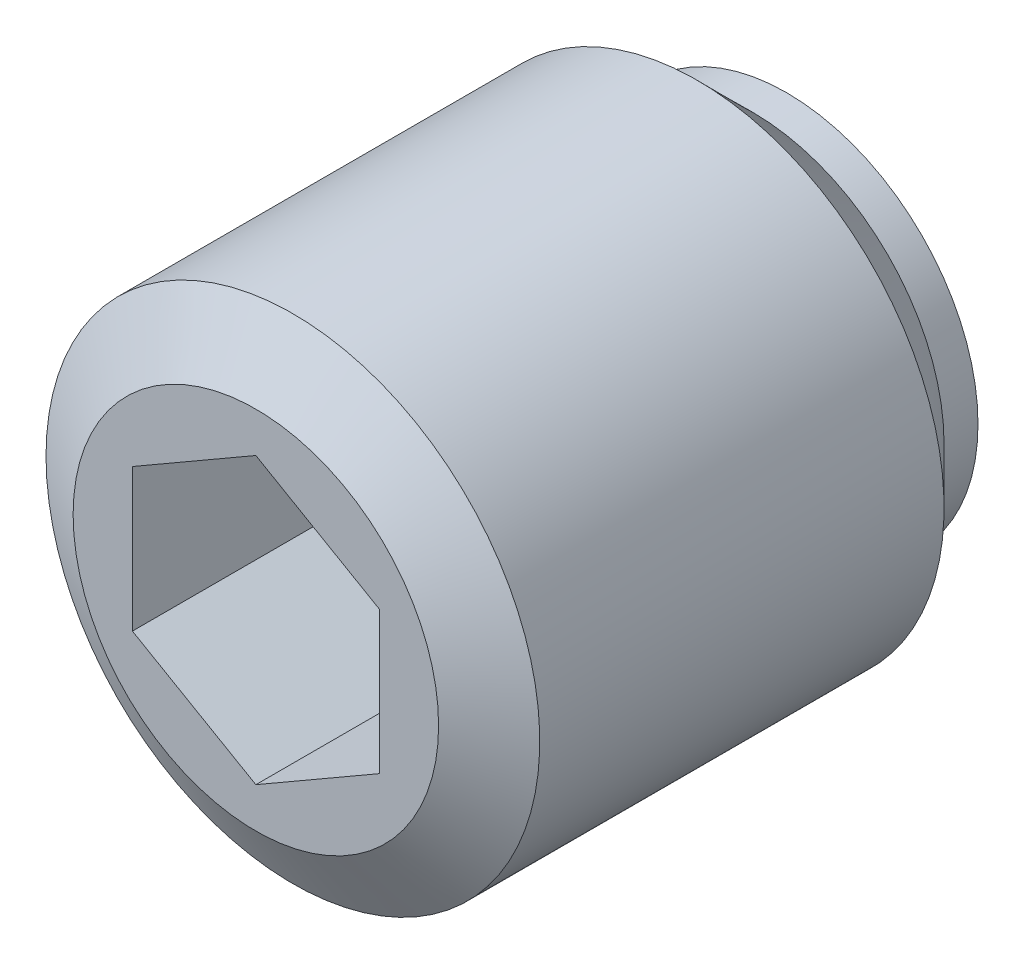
ISO-10303-21;
HEADER;
FILE_DESCRIPTION(('STEP AP214'),'2;1');
FILE_NAME('part.step','',(''),(''),'','','');
FILE_SCHEMA(('AUTOMOTIVE_DESIGN { 1 0 10303 214 1 1 1 1 }'));
ENDSEC;
DATA;
#1=APPLICATION_CONTEXT('core data for automotive mechanical design processes');
#2=APPLICATION_PROTOCOL_DEFINITION('international standard','automotive_design',2000,#1);
#3=PRODUCT_CONTEXT('',#1,'mechanical');
#4=PRODUCT('Part','Part','',(#3));
#5=PRODUCT_RELATED_PRODUCT_CATEGORY('part','',(#4));
#6=PRODUCT_DEFINITION_FORMATION('','',#4);
#7=PRODUCT_DEFINITION_CONTEXT('part definition',#1,'design');
#8=PRODUCT_DEFINITION('design','',#6,#7);
#9=PRODUCT_DEFINITION_SHAPE('','',#8);
#10=(LENGTH_UNIT() NAMED_UNIT(*) SI_UNIT(.MILLI.,.METRE.));
#11=(NAMED_UNIT(*) PLANE_ANGLE_UNIT() SI_UNIT($,.RADIAN.));
#12=(NAMED_UNIT(*) SI_UNIT($,.STERADIAN.) SOLID_ANGLE_UNIT());
#13=UNCERTAINTY_MEASURE_WITH_UNIT(LENGTH_MEASURE(1.E-05),#10,'distance_accuracy_value','');
#14=(GEOMETRIC_REPRESENTATION_CONTEXT(3) GLOBAL_UNCERTAINTY_ASSIGNED_CONTEXT((#13)) GLOBAL_UNIT_ASSIGNED_CONTEXT((#10,
#11,#12)) REPRESENTATION_CONTEXT('',''));
#15=CARTESIAN_POINT('',(0.,0.,0.));
#16=DIRECTION('',(0.,0.,1.));
#17=DIRECTION('',(1.,0.,0.));
#18=AXIS2_PLACEMENT_3D('',#15,#16,#17);
#19=CARTESIAN_POINT('',(0.,0.,2.75));
#20=DIRECTION('',(0.,0.,1.));
#21=DIRECTION('',(0.,-1.,0.));
#22=AXIS2_PLACEMENT_3D('',#19,#20,#21);
#23=SPHERICAL_SURFACE('',#22,2.75);
#24=CARTESIAN_POINT('',(0.,0.,1.4));
#25=DIRECTION('',(0.,0.,1.));
#26=DIRECTION('',(-1.,0.,0.));
#27=AXIS2_PLACEMENT_3D('',#24,#25,#26);
#28=CIRCLE('',#27,2.39582971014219);
#29=CARTESIAN_POINT('',(-2.39582971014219,0.,1.4));
#30=VERTEX_POINT('',#29);
#31=EDGE_CURVE('E9',#30,#30,#28,.T.);
#32=ORIENTED_EDGE('',*,*,#31,.F.);
#33=EDGE_LOOP('',(#32));
#34=FACE_BOUND('',#33,.T.);
#35=ADVANCED_FACE('F14',(#34),#23,.T.);
#36=CARTESIAN_POINT('',(0.,3.1,1.4));
#37=DIRECTION('',(0.,0.,1.));
#38=DIRECTION('',(-1.,0.,0.));
#39=AXIS2_PLACEMENT_3D('',#36,#37,#38);
#40=PLANE('',#39);
#41=CARTESIAN_POINT('',(0.,0.,1.4));
#42=DIRECTION('',(0.,0.,1.));
#43=DIRECTION('',(-1.,0.,0.));
#44=AXIS2_PLACEMENT_3D('',#41,#42,#43);
#45=CIRCLE('',#44,3.1);
#46=CARTESIAN_POINT('',(-3.1,0.,1.4));
#47=VERTEX_POINT('',#46);
#48=EDGE_CURVE('E21',#47,#47,#45,.T.);
#49=ORIENTED_EDGE('',*,*,#48,.F.);
#50=EDGE_LOOP('',(#49));
#51=FACE_BOUND('',#50,.T.);
#52=ORIENTED_EDGE('',*,*,#31,.T.);
#53=EDGE_LOOP('',(#52));
#54=FACE_BOUND('',#53,.T.);
#55=ADVANCED_FACE('F138',(#51,#54),#40,.F.);
#56=CARTESIAN_POINT('',(0.,0.,11.3950749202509));
#57=DIRECTION('',(0.,0.,1.));
#58=DIRECTION('',(-1.,0.,0.));
#59=AXIS2_PLACEMENT_3D('',#56,#57,#58);
#60=CYLINDRICAL_SURFACE('',#59,3.1);
#61=CARTESIAN_POINT('',(0.,0.,1.95));
#62=DIRECTION('',(0.,0.,1.));
#63=DIRECTION('',(-1.,0.,0.));
#64=AXIS2_PLACEMENT_3D('',#61,#62,#63);
#65=CIRCLE('',#64,3.1);
#66=CARTESIAN_POINT('',(-3.1,0.,1.95));
#67=VERTEX_POINT('',#66);
#68=EDGE_CURVE('E131',#67,#67,#65,.T.);
#69=ORIENTED_EDGE('',*,*,#68,.F.);
#70=EDGE_LOOP('',(#69));
#71=FACE_BOUND('',#70,.T.);
#72=ORIENTED_EDGE('',*,*,#48,.T.);
#73=EDGE_LOOP('',(#72));
#74=FACE_BOUND('',#73,.T.);
#75=ADVANCED_FACE('F136',(#71,#74),#60,.T.);
#76=CARTESIAN_POINT('',(0.,0.,1.95));
#77=DIRECTION('',(0.,0.,1.));
#78=DIRECTION('',(-1.,0.,0.));
#79=AXIS2_PLACEMENT_3D('',#76,#77,#78);
#80=CONICAL_SURFACE('',#79,3.1,0.78539816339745);
#81=CARTESIAN_POINT('',(0.,0.,2.85));
#82=DIRECTION('',(0.,0.,1.));
#83=DIRECTION('',(-1.,0.,0.));
#84=AXIS2_PLACEMENT_3D('',#81,#82,#83);
#85=CIRCLE('',#84,4.);
#86=CARTESIAN_POINT('',(-4.,0.,2.85));
#87=VERTEX_POINT('',#86);
#88=EDGE_CURVE('E128',#87,#87,#85,.T.);
#89=ORIENTED_EDGE('',*,*,#88,.F.);
#90=EDGE_LOOP('',(#89));
#91=FACE_BOUND('',#90,.T.);
#92=ORIENTED_EDGE('',*,*,#68,.T.);
#93=EDGE_LOOP('',(#92));
#94=FACE_BOUND('',#93,.T.);
#95=ADVANCED_FACE('F161',(#91,#94),#80,.T.);
#96=CARTESIAN_POINT('',(0.,0.,11.3950749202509));
#97=DIRECTION('',(0.,0.,1.));
#98=DIRECTION('',(-1.,0.,0.));
#99=AXIS2_PLACEMENT_3D('',#96,#97,#98);
#100=CYLINDRICAL_SURFACE('',#99,4.);
#101=CARTESIAN_POINT('',(0.,0.,9.4));
#102=DIRECTION('',(0.,0.,1.));
#103=DIRECTION('',(-1.,0.,0.));
#104=AXIS2_PLACEMENT_3D('',#101,#102,#103);
#105=CIRCLE('',#104,4.);
#106=CARTESIAN_POINT('',(-4.,0.,9.4));
#107=VERTEX_POINT('',#106);
#108=EDGE_CURVE('E125',#107,#107,#105,.T.);
#109=ORIENTED_EDGE('',*,*,#108,.F.);
#110=EDGE_LOOP('',(#109));
#111=FACE_BOUND('',#110,.T.);
#112=ORIENTED_EDGE('',*,*,#88,.T.);
#113=EDGE_LOOP('',(#112));
#114=FACE_BOUND('',#113,.T.);
#115=ADVANCED_FACE('F170',(#111,#114),#100,.T.);
#116=CARTESIAN_POINT('',(0.,0.,9.4));
#117=DIRECTION('',(0.,0.,-1.));
#118=DIRECTION('',(1.,0.,0.));
#119=AXIS2_PLACEMENT_3D('',#116,#117,#118);
#120=CONICAL_SURFACE('',#119,4.,1.04719755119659);
#121=CARTESIAN_POINT('',(0.,0.,10.));
#122=DIRECTION('',(0.,0.,1.));
#123=DIRECTION('',(-1.,0.,0.));
#124=AXIS2_PLACEMENT_3D('',#121,#122,#123);
#125=CIRCLE('',#124,2.9607695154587);
#126=CARTESIAN_POINT('',(-2.9607695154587,0.,10.));
#127=VERTEX_POINT('',#126);
#128=EDGE_CURVE('E116',#127,#127,#125,.T.);
#129=ORIENTED_EDGE('',*,*,#128,.F.);
#130=EDGE_LOOP('',(#129));
#131=FACE_BOUND('',#130,.T.);
#132=ORIENTED_EDGE('',*,*,#108,.T.);
#133=EDGE_LOOP('',(#132));
#134=FACE_BOUND('',#133,.T.);
#135=ADVANCED_FACE('F179',(#131,#134),#120,.T.);
#136=CARTESIAN_POINT('',(0.,0.,10.));
#137=DIRECTION('',(0.,0.,-1.));
#138=DIRECTION('',(1.,0.,0.));
#139=AXIS2_PLACEMENT_3D('',#136,#137,#138);
#140=PLANE('',#139);
#141=DIRECTION('',(-0.866025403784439,-0.5,0.));
#142=VECTOR('',#141,1.);
#143=CARTESIAN_POINT('',(0.,2.30940107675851,10.));
#144=LINE('',#143,#142);
#145=CARTESIAN_POINT('',(0.,2.30940107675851,10.));
#146=VERTEX_POINT('',#145);
#147=CARTESIAN_POINT('',(-2.,1.15470053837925,10.));
#148=VERTEX_POINT('',#147);
#149=EDGE_CURVE('E82',#146,#148,#144,.T.);
#150=ORIENTED_EDGE('',*,*,#149,.F.);
#151=DIRECTION('',(-0.866025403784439,0.5,0.));
#152=VECTOR('',#151,1.);
#153=CARTESIAN_POINT('',(2.,1.15470053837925,10.));
#154=LINE('',#153,#152);
#155=CARTESIAN_POINT('',(2.,1.15470053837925,10.));
#156=VERTEX_POINT('',#155);
#157=EDGE_CURVE('E28',#156,#146,#154,.T.);
#158=ORIENTED_EDGE('',*,*,#157,.F.);
#159=DIRECTION('',(0.,1.,0.));
#160=VECTOR('',#159,1.);
#161=CARTESIAN_POINT('',(2.,-1.15470053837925,10.));
#162=LINE('',#161,#160);
#163=CARTESIAN_POINT('',(2.,-1.15470053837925,10.));
#164=VERTEX_POINT('',#163);
#165=EDGE_CURVE('E98',#164,#156,#162,.T.);
#166=ORIENTED_EDGE('',*,*,#165,.F.);
#167=DIRECTION('',(0.866025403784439,0.5,0.));
#168=VECTOR('',#167,1.);
#169=CARTESIAN_POINT('',(0.,-2.30940107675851,10.));
#170=LINE('',#169,#168);
#171=CARTESIAN_POINT('',(0.,-2.30940107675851,10.));
#172=VERTEX_POINT('',#171);
#173=EDGE_CURVE('E92',#172,#164,#170,.T.);
#174=ORIENTED_EDGE('',*,*,#173,.F.);
#175=DIRECTION('',(0.866025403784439,-0.5,0.));
#176=VECTOR('',#175,1.);
#177=CARTESIAN_POINT('',(-2.,-1.15470053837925,10.));
#178=LINE('',#177,#176);
#179=CARTESIAN_POINT('',(-2.,-1.15470053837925,10.));
#180=VERTEX_POINT('',#179);
#181=EDGE_CURVE('E90',#180,#172,#178,.T.);
#182=ORIENTED_EDGE('',*,*,#181,.F.);
#183=DIRECTION('',(0.,-1.,0.));
#184=VECTOR('',#183,1.);
#185=CARTESIAN_POINT('',(-2.,1.15470053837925,10.));
#186=LINE('',#185,#184);
#187=EDGE_CURVE('E71',#148,#180,#186,.T.);
#188=ORIENTED_EDGE('',*,*,#187,.F.);
#189=EDGE_LOOP('',(#150,#158,#166,#174,#182,#188));
#190=FACE_BOUND('',#189,.T.);
#191=ORIENTED_EDGE('',*,*,#128,.T.);
#192=EDGE_LOOP('',(#191));
#193=FACE_BOUND('',#192,.T.);
#194=ADVANCED_FACE('F86',(#190,#193),#140,.F.);
#195=CARTESIAN_POINT('',(2.,1.15470053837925,6.));
#196=DIRECTION('',(0.5,0.866025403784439,0.));
#197=DIRECTION('',(0.866025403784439,-0.5,0.));
#198=AXIS2_PLACEMENT_3D('',#195,#196,#197);
#199=PLANE('',#198);
#200=ORIENTED_EDGE('',*,*,#157,.T.);
#201=DIRECTION('',(0.,0.,1.));
#202=VECTOR('',#201,1.);
#203=CARTESIAN_POINT('',(0.,2.30940107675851,6.));
#204=LINE('',#203,#202);
#205=CARTESIAN_POINT('',(0.,2.30940107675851,6.));
#206=VERTEX_POINT('',#205);
#207=EDGE_CURVE('E79',#206,#146,#204,.T.);
#208=ORIENTED_EDGE('',*,*,#207,.F.);
#209=DIRECTION('',(-0.866025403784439,0.5,0.));
#210=VECTOR('',#209,1.);
#211=CARTESIAN_POINT('',(2.,1.15470053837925,6.));
#212=LINE('',#211,#210);
#213=CARTESIAN_POINT('',(2.,1.15470053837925,6.));
#214=VERTEX_POINT('',#213);
#215=EDGE_CURVE('E100',#214,#206,#212,.T.);
#216=ORIENTED_EDGE('',*,*,#215,.F.);
#217=DIRECTION('',(0.,0.,1.));
#218=VECTOR('',#217,1.);
#219=CARTESIAN_POINT('',(2.,1.15470053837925,6.));
#220=LINE('',#219,#218);
#221=EDGE_CURVE('E35',#214,#156,#220,.T.);
#222=ORIENTED_EDGE('',*,*,#221,.T.);
#223=EDGE_LOOP('',(#200,#208,#216,#222));
#224=FACE_BOUND('',#223,.T.);
#225=ADVANCED_FACE('F196',(#224),#199,.F.);
#226=CARTESIAN_POINT('',(2.,-1.15470053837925,6.));
#227=DIRECTION('',(1.,0.,0.));
#228=DIRECTION('',(0.,0.,1.));
#229=AXIS2_PLACEMENT_3D('',#226,#227,#228);
#230=PLANE('',#229);
#231=ORIENTED_EDGE('',*,*,#165,.T.);
#232=ORIENTED_EDGE('',*,*,#221,.F.);
#233=DIRECTION('',(0.,1.,0.));
#234=VECTOR('',#233,1.);
#235=CARTESIAN_POINT('',(2.,-1.15470053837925,6.));
#236=LINE('',#235,#234);
#237=CARTESIAN_POINT('',(2.,-1.15470053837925,6.));
#238=VERTEX_POINT('',#237);
#239=EDGE_CURVE('E112',#238,#214,#236,.T.);
#240=ORIENTED_EDGE('',*,*,#239,.F.);
#241=DIRECTION('',(0.,0.,1.));
#242=VECTOR('',#241,1.);
#243=CARTESIAN_POINT('',(2.,-1.15470053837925,6.));
#244=LINE('',#243,#242);
#245=EDGE_CURVE('E117',#238,#164,#244,.T.);
#246=ORIENTED_EDGE('',*,*,#245,.T.);
#247=EDGE_LOOP('',(#231,#232,#240,#246));
#248=FACE_BOUND('',#247,.T.);
#249=ADVANCED_FACE('F204',(#248),#230,.F.);
#250=CARTESIAN_POINT('',(0.,-2.30940107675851,6.));
#251=DIRECTION('',(0.5,-0.866025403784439,0.));
#252=DIRECTION('',(-0.866025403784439,-0.5,0.));
#253=AXIS2_PLACEMENT_3D('',#250,#251,#252);
#254=PLANE('',#253);
#255=ORIENTED_EDGE('',*,*,#173,.T.);
#256=ORIENTED_EDGE('',*,*,#245,.F.);
#257=DIRECTION('',(0.866025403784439,0.5,0.));
#258=VECTOR('',#257,1.);
#259=CARTESIAN_POINT('',(0.,-2.30940107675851,6.));
#260=LINE('',#259,#258);
#261=CARTESIAN_POINT('',(0.,-2.30940107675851,6.));
#262=VERTEX_POINT('',#261);
#263=EDGE_CURVE('E109',#262,#238,#260,.T.);
#264=ORIENTED_EDGE('',*,*,#263,.F.);
#265=DIRECTION('',(0.,0.,1.));
#266=VECTOR('',#265,1.);
#267=CARTESIAN_POINT('',(0.,-2.30940107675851,6.));
#268=LINE('',#267,#266);
#269=EDGE_CURVE('E119',#262,#172,#268,.T.);
#270=ORIENTED_EDGE('',*,*,#269,.T.);
#271=EDGE_LOOP('',(#255,#256,#264,#270));
#272=FACE_BOUND('',#271,.T.);
#273=ADVANCED_FACE('F212',(#272),#254,.F.);
#274=CARTESIAN_POINT('',(-2.,-1.15470053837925,6.));
#275=DIRECTION('',(-0.5,-0.866025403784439,0.));
#276=DIRECTION('',(-0.866025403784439,0.5,0.));
#277=AXIS2_PLACEMENT_3D('',#274,#275,#276);
#278=PLANE('',#277);
#279=ORIENTED_EDGE('',*,*,#181,.T.);
#280=ORIENTED_EDGE('',*,*,#269,.F.);
#281=DIRECTION('',(0.866025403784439,-0.5,0.));
#282=VECTOR('',#281,1.);
#283=CARTESIAN_POINT('',(-2.,-1.15470053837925,6.));
#284=LINE('',#283,#282);
#285=CARTESIAN_POINT('',(-2.,-1.15470053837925,6.));
#286=VERTEX_POINT('',#285);
#287=EDGE_CURVE('E106',#286,#262,#284,.T.);
#288=ORIENTED_EDGE('',*,*,#287,.F.);
#289=DIRECTION('',(0.,0.,1.));
#290=VECTOR('',#289,1.);
#291=CARTESIAN_POINT('',(-2.,-1.15470053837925,6.));
#292=LINE('',#291,#290);
#293=EDGE_CURVE('E78',#286,#180,#292,.T.);
#294=ORIENTED_EDGE('',*,*,#293,.T.);
#295=EDGE_LOOP('',(#279,#280,#288,#294));
#296=FACE_BOUND('',#295,.T.);
#297=ADVANCED_FACE('F220',(#296),#278,.F.);
#298=CARTESIAN_POINT('',(-2.,1.15470053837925,6.));
#299=DIRECTION('',(-1.,0.,0.));
#300=DIRECTION('',(0.,1.,0.));
#301=AXIS2_PLACEMENT_3D('',#298,#299,#300);
#302=PLANE('',#301);
#303=ORIENTED_EDGE('',*,*,#187,.T.);
#304=ORIENTED_EDGE('',*,*,#293,.F.);
#305=DIRECTION('',(0.,-1.,0.));
#306=VECTOR('',#305,1.);
#307=CARTESIAN_POINT('',(-2.,1.15470053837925,6.));
#308=LINE('',#307,#306);
#309=CARTESIAN_POINT('',(-2.,1.15470053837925,6.));
#310=VERTEX_POINT('',#309);
#311=EDGE_CURVE('E74',#310,#286,#308,.T.);
#312=ORIENTED_EDGE('',*,*,#311,.F.);
#313=DIRECTION('',(0.,0.,1.));
#314=VECTOR('',#313,1.);
#315=CARTESIAN_POINT('',(-2.,1.15470053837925,6.));
#316=LINE('',#315,#314);
#317=EDGE_CURVE('E67',#310,#148,#316,.T.);
#318=ORIENTED_EDGE('',*,*,#317,.T.);
#319=EDGE_LOOP('',(#303,#304,#312,#318));
#320=FACE_BOUND('',#319,.T.);
#321=ADVANCED_FACE('F69',(#320),#302,.F.);
#322=CARTESIAN_POINT('',(0.,2.30940107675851,6.));
#323=DIRECTION('',(-0.5,0.866025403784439,0.));
#324=DIRECTION('',(0.866025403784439,0.5,0.));
#325=AXIS2_PLACEMENT_3D('',#322,#323,#324);
#326=PLANE('',#325);
#327=ORIENTED_EDGE('',*,*,#149,.T.);
#328=ORIENTED_EDGE('',*,*,#317,.F.);
#329=DIRECTION('',(-0.866025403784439,-0.5,0.));
#330=VECTOR('',#329,1.);
#331=CARTESIAN_POINT('',(0.,2.30940107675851,6.));
#332=LINE('',#331,#330);
#333=EDGE_CURVE('E103',#206,#310,#332,.T.);
#334=ORIENTED_EDGE('',*,*,#333,.F.);
#335=ORIENTED_EDGE('',*,*,#207,.T.);
#336=EDGE_LOOP('',(#327,#328,#334,#335));
#337=FACE_BOUND('',#336,.T.);
#338=ADVANCED_FACE('F83',(#337),#326,.F.);
#339=CARTESIAN_POINT('',(2.,1.15470053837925,6.));
#340=DIRECTION('',(0.,0.,-1.));
#341=DIRECTION('',(1.,0.,0.));
#342=AXIS2_PLACEMENT_3D('',#339,#340,#341);
#343=PLANE('',#342);
#344=ORIENTED_EDGE('',*,*,#215,.T.);
#345=ORIENTED_EDGE('',*,*,#333,.T.);
#346=ORIENTED_EDGE('',*,*,#311,.T.);
#347=ORIENTED_EDGE('',*,*,#287,.T.);
#348=ORIENTED_EDGE('',*,*,#263,.T.);
#349=ORIENTED_EDGE('',*,*,#239,.T.);
#350=EDGE_LOOP('',(#344,#345,#346,#347,#348,#349));
#351=FACE_BOUND('',#350,.T.);
#352=ADVANCED_FACE('F244',(#351),#343,.F.);
#353=CLOSED_SHELL('',(#35,#55,#75,#95,#115,#135,#194,#225,#249,#273,#297,#321,#338,#352));
#354=MANIFOLD_SOLID_BREP('B1',#353);
#355=ADVANCED_BREP_SHAPE_REPRESENTATION('',(#18,#354),#14);
#356=SHAPE_DEFINITION_REPRESENTATION(#9,#355);
ENDSEC;
END-ISO-10303-21;
